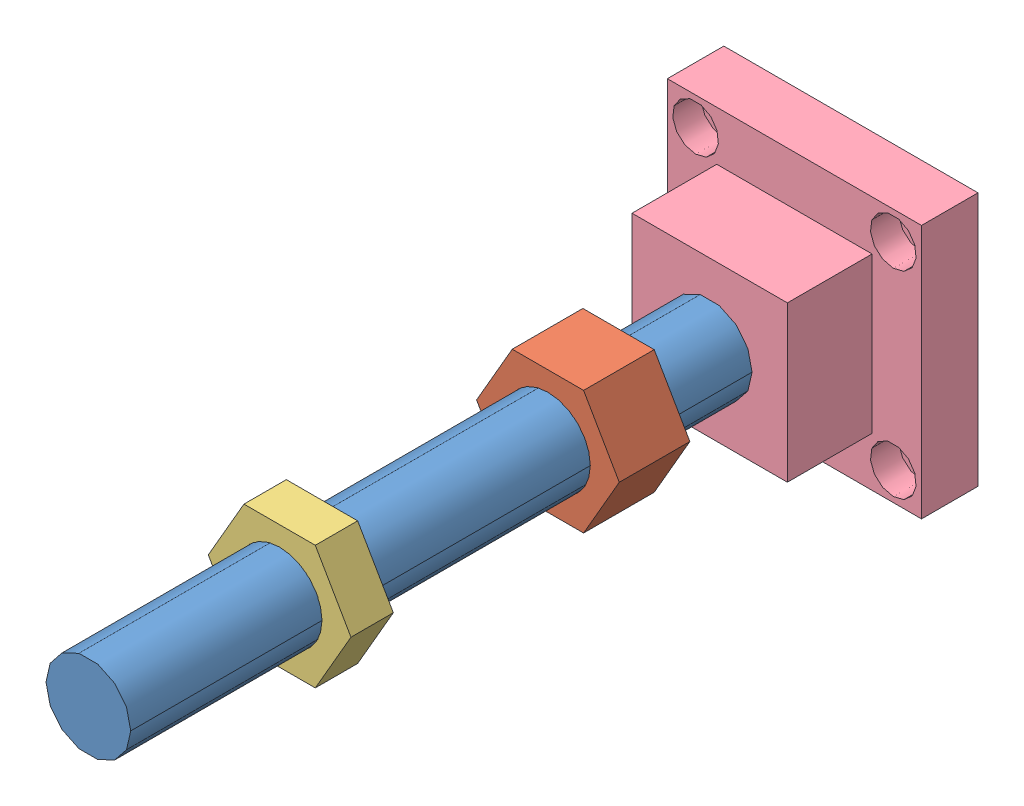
SolidWorks assembly 1080 LEFT KM SUPPORT.sldasm, configuration K1 (file format 4400). Lengths in mm.
Overall size (114.3 114.3 342.9).
7 component instances, 7 part files, 6 mates.
Components (placement in the parent):
- _U249-2-1: _U249-2.sldprt [Default] at origin
- _U258-2-1: _U258-2.sldprt [Default] at (0 0 -183.0275) (suppressed, hidden)
- _U259-2-1: _U259-2.sldprt [Default] at (0 0 -173.8312) (suppressed, hidden)
- _U260-2-1: _U260-2.sldprt [Default] at (0 0 -196.85) (suppressed, hidden)
- _U286-2-1: _U286-2.sldprt [Default] at (0 0 -70.1319)
- _U287-2-1: _U287-2.sldprt [Default] at (0 0 56.8681)
- 1080-C1017 BASE PAD, OSIRIS, KECK 1-1: 1080-C1017 BASE PAD, OSIRIS, KECK 1.SLDPRT [Default] at (-57.15 -57.15 -190.5) x (1 0 0) z (0 -1 0)
Mates (geometry in assembly coordinates):
- Concentric1: concentric aligned: cylinder of _U249-2-1 through (0 0 -152.4) axis (0 0 1) radius 19.05; cylinder of 1080-C1017 BASE PAD, OSIRIS, KECK 1-1 through (0 0 -127) axis (0 0 1) radius 12.7
- Parallel1: parallel aligned: plane of 1080-C1017 BASE PAD, OSIRIS, KECK 1-1; plane of assembly through (0 0 0) normal (1 0 0)
- Distance1: distance = 25.4 mm anti-aligned: plane of 1080-C1017 BASE PAD, OSIRIS, KECK 1-1 through (-34.925 34.925 -127) normal (0 0 1); plane of _U249-2-1 through (0 0 -152.4) normal (0 0 -1)
- Concentric2: concentric aligned: cylinder of _U249-2-1 through (0 0 -152.4) axis (0 0 1) radius 19.05; cylinder of _U287-2-1 through (0 0 -167.4359) axis (0 0 1) radius 19.05
- Distance2: distance = 174.3431 mm anti-aligned: plane of 1080-C1017 BASE PAD, OSIRIS, KECK 1-1 through (-34.925 34.925 -127) normal (0 0 1); plane of _U287-2-1 through (0 0 47.3431) normal (0 0 -1)
- Distance3: distance = 101.6 mm anti-aligned: plane of _U287-2-1 through (0 0 47.3431) normal (0 0 -1); plane of _U286-2-1 through (-16.0395 27.7812 -54.2569) normal (0 0 1)
